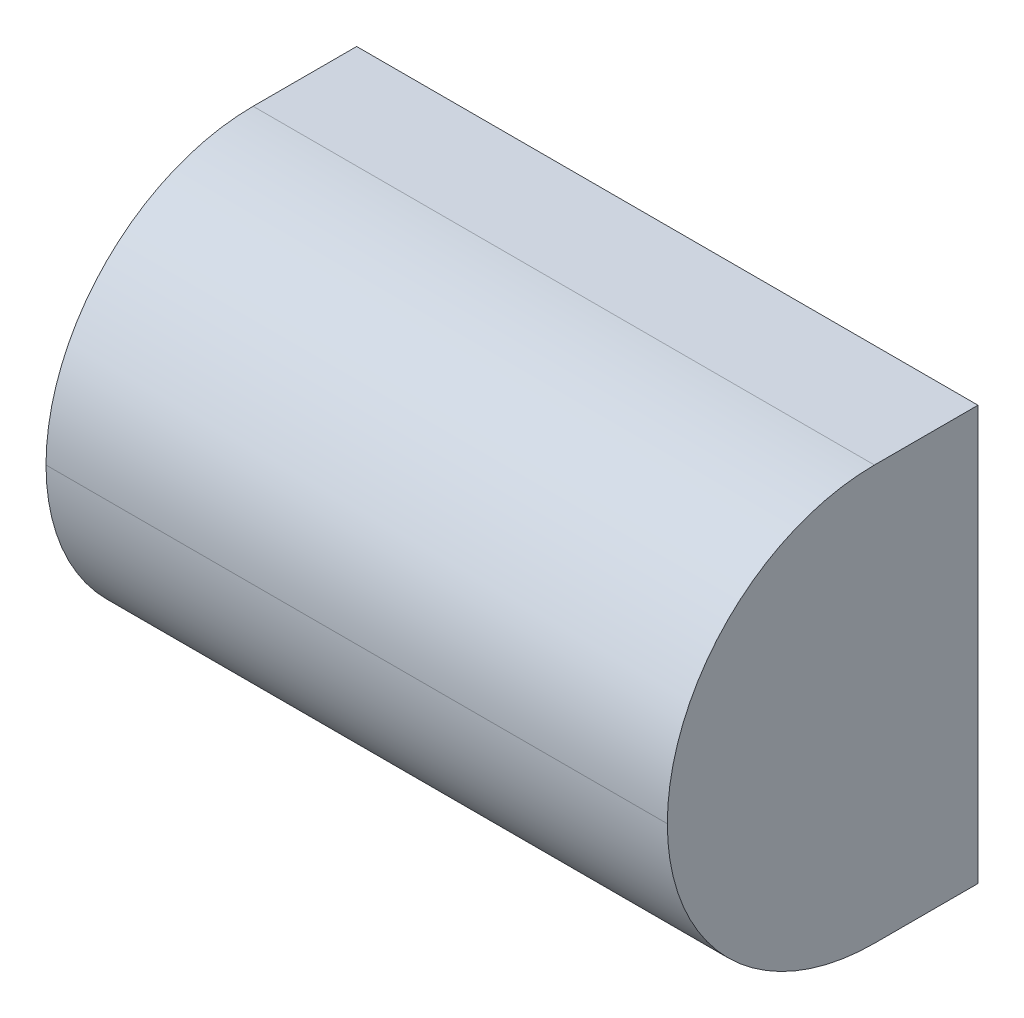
ISO-10303-21;
HEADER;
FILE_DESCRIPTION(('STEP AP214'),'2;1');
FILE_NAME('part.step','',(''),(''),'','','');
FILE_SCHEMA(('AUTOMOTIVE_DESIGN { 1 0 10303 214 1 1 1 1 }'));
ENDSEC;
DATA;
#1=APPLICATION_CONTEXT('core data for automotive mechanical design processes');
#2=APPLICATION_PROTOCOL_DEFINITION('international standard','automotive_design',2000,#1);
#3=PRODUCT_CONTEXT('',#1,'mechanical');
#4=PRODUCT('Part','Part','',(#3));
#5=PRODUCT_RELATED_PRODUCT_CATEGORY('part','',(#4));
#6=PRODUCT_DEFINITION_FORMATION('','',#4);
#7=PRODUCT_DEFINITION_CONTEXT('part definition',#1,'design');
#8=PRODUCT_DEFINITION('design','',#6,#7);
#9=PRODUCT_DEFINITION_SHAPE('','',#8);
#10=(LENGTH_UNIT() NAMED_UNIT(*) SI_UNIT(.MILLI.,.METRE.));
#11=(NAMED_UNIT(*) PLANE_ANGLE_UNIT() SI_UNIT($,.RADIAN.));
#12=(NAMED_UNIT(*) SI_UNIT($,.STERADIAN.) SOLID_ANGLE_UNIT());
#13=UNCERTAINTY_MEASURE_WITH_UNIT(LENGTH_MEASURE(1.E-05),#10,'distance_accuracy_value','');
#14=(GEOMETRIC_REPRESENTATION_CONTEXT(3) GLOBAL_UNCERTAINTY_ASSIGNED_CONTEXT((#13)) GLOBAL_UNIT_ASSIGNED_CONTEXT((#10,
#11,#12)) REPRESENTATION_CONTEXT('',''));
#15=CARTESIAN_POINT('',(0.,0.,0.));
#16=DIRECTION('',(0.,0.,1.));
#17=DIRECTION('',(1.,0.,0.));
#18=AXIS2_PLACEMENT_3D('',#15,#16,#17);
#19=CARTESIAN_POINT('',(-4.5,3.,4.5));
#20=DIRECTION('',(1.,0.,0.));
#21=DIRECTION('',(0.,1.,0.));
#22=AXIS2_PLACEMENT_3D('',#19,#20,#21);
#23=PLANE('',#22);
#24=DIRECTION('',(0.,0.,-1.));
#25=VECTOR('',#24,1.);
#26=CARTESIAN_POINT('',(-4.5,-3.,4.5));
#27=LINE('',#26,#25);
#28=CARTESIAN_POINT('',(-4.5,-3.,1.5));
#29=VERTEX_POINT('',#28);
#30=CARTESIAN_POINT('',(-4.5,-3.,0.));
#31=VERTEX_POINT('',#30);
#32=EDGE_CURVE('E75',#29,#31,#27,.T.);
#33=ORIENTED_EDGE('',*,*,#32,.F.);
#34=CARTESIAN_POINT('',(-4.5,0.,1.5));
#35=DIRECTION('',(1.,0.,0.));
#36=DIRECTION('',(0.,1.,0.));
#37=AXIS2_PLACEMENT_3D('',#34,#35,#36);
#38=CIRCLE('',#37,3.);
#39=CARTESIAN_POINT('',(-4.5,0.,4.5));
#40=VERTEX_POINT('',#39);
#41=EDGE_CURVE('E40',#29,#40,#38,.F.);
#42=ORIENTED_EDGE('',*,*,#41,.T.);
#43=CARTESIAN_POINT('',(-4.5,0.,1.5));
#44=DIRECTION('',(1.,0.,0.));
#45=DIRECTION('',(0.,1.,0.));
#46=AXIS2_PLACEMENT_3D('',#43,#44,#45);
#47=CIRCLE('',#46,3.);
#48=CARTESIAN_POINT('',(-4.5,3.,1.5));
#49=VERTEX_POINT('',#48);
#50=EDGE_CURVE('E47',#40,#49,#47,.F.);
#51=ORIENTED_EDGE('',*,*,#50,.T.);
#52=DIRECTION('',(0.,0.,-1.));
#53=VECTOR('',#52,1.);
#54=CARTESIAN_POINT('',(-4.5,3.,4.5));
#55=LINE('',#54,#53);
#56=CARTESIAN_POINT('',(-4.5,3.,0.));
#57=VERTEX_POINT('',#56);
#58=EDGE_CURVE('E95',#49,#57,#55,.T.);
#59=ORIENTED_EDGE('',*,*,#58,.T.);
#60=DIRECTION('',(0.,-1.,0.));
#61=VECTOR('',#60,1.);
#62=CARTESIAN_POINT('',(-4.5,3.,0.));
#63=LINE('',#62,#61);
#64=EDGE_CURVE('E91',#57,#31,#63,.T.);
#65=ORIENTED_EDGE('',*,*,#64,.T.);
#66=EDGE_LOOP('',(#33,#42,#51,#59,#65));
#67=FACE_BOUND('',#66,.T.);
#68=ADVANCED_FACE('F33',(#67),#23,.F.);
#69=CARTESIAN_POINT('',(-4.5,-3.,4.5));
#70=DIRECTION('',(0.,1.,0.));
#71=DIRECTION('',(0.,0.,1.));
#72=AXIS2_PLACEMENT_3D('',#69,#70,#71);
#73=PLANE('',#72);
#74=DIRECTION('',(0.,0.,-1.));
#75=VECTOR('',#74,1.);
#76=CARTESIAN_POINT('',(4.5,-3.,4.5));
#77=LINE('',#76,#75);
#78=CARTESIAN_POINT('',(4.5,-3.,1.5));
#79=VERTEX_POINT('',#78);
#80=CARTESIAN_POINT('',(4.5,-3.,0.));
#81=VERTEX_POINT('',#80);
#82=EDGE_CURVE('E85',#79,#81,#77,.T.);
#83=ORIENTED_EDGE('',*,*,#82,.F.);
#84=DIRECTION('',(1.,0.,0.));
#85=VECTOR('',#84,1.);
#86=CARTESIAN_POINT('',(-4.5,-3.,1.5));
#87=LINE('',#86,#85);
#88=EDGE_CURVE('E82',#79,#29,#87,.F.);
#89=ORIENTED_EDGE('',*,*,#88,.T.);
#90=ORIENTED_EDGE('',*,*,#32,.T.);
#91=DIRECTION('',(1.,0.,0.));
#92=VECTOR('',#91,1.);
#93=CARTESIAN_POINT('',(-4.5,-3.,0.));
#94=LINE('',#93,#92);
#95=EDGE_CURVE('E79',#31,#81,#94,.T.);
#96=ORIENTED_EDGE('',*,*,#95,.T.);
#97=EDGE_LOOP('',(#83,#89,#90,#96));
#98=FACE_BOUND('',#97,.T.);
#99=ADVANCED_FACE('F78',(#98),#73,.F.);
#100=CARTESIAN_POINT('',(4.5,3.,4.5));
#101=DIRECTION('',(-1.,0.,0.));
#102=DIRECTION('',(0.,-1.,0.));
#103=AXIS2_PLACEMENT_3D('',#100,#101,#102);
#104=PLANE('',#103);
#105=CARTESIAN_POINT('',(4.5,0.,1.5));
#106=DIRECTION('',(-1.,0.,0.));
#107=DIRECTION('',(0.,-1.,0.));
#108=AXIS2_PLACEMENT_3D('',#105,#106,#107);
#109=CIRCLE('',#108,3.);
#110=CARTESIAN_POINT('',(4.5,3.,1.5));
#111=VERTEX_POINT('',#110);
#112=CARTESIAN_POINT('',(4.5,0.,4.5));
#113=VERTEX_POINT('',#112);
#114=EDGE_CURVE('E84',#111,#113,#109,.F.);
#115=ORIENTED_EDGE('',*,*,#114,.T.);
#116=CARTESIAN_POINT('',(4.5,0.,1.5));
#117=DIRECTION('',(-1.,0.,0.));
#118=DIRECTION('',(0.,-1.,0.));
#119=AXIS2_PLACEMENT_3D('',#116,#117,#118);
#120=CIRCLE('',#119,3.);
#121=EDGE_CURVE('E110',#113,#79,#120,.F.);
#122=ORIENTED_EDGE('',*,*,#121,.T.);
#123=ORIENTED_EDGE('',*,*,#82,.T.);
#124=DIRECTION('',(0.,1.,0.));
#125=VECTOR('',#124,1.);
#126=CARTESIAN_POINT('',(4.5,3.,0.));
#127=LINE('',#126,#125);
#128=CARTESIAN_POINT('',(4.5,3.,0.));
#129=VERTEX_POINT('',#128);
#130=EDGE_CURVE('E93',#81,#129,#127,.T.);
#131=ORIENTED_EDGE('',*,*,#130,.T.);
#132=DIRECTION('',(0.,0.,-1.));
#133=VECTOR('',#132,1.);
#134=CARTESIAN_POINT('',(4.5,3.,4.5));
#135=LINE('',#134,#133);
#136=EDGE_CURVE('E106',#111,#129,#135,.T.);
#137=ORIENTED_EDGE('',*,*,#136,.F.);
#138=EDGE_LOOP('',(#115,#122,#123,#131,#137));
#139=FACE_BOUND('',#138,.T.);
#140=ADVANCED_FACE('F115',(#139),#104,.F.);
#141=CARTESIAN_POINT('',(-4.5,3.,4.5));
#142=DIRECTION('',(0.,-1.,0.));
#143=DIRECTION('',(0.,0.,-1.));
#144=AXIS2_PLACEMENT_3D('',#141,#142,#143);
#145=PLANE('',#144);
#146=ORIENTED_EDGE('',*,*,#58,.F.);
#147=DIRECTION('',(-1.,0.,0.));
#148=VECTOR('',#147,1.);
#149=CARTESIAN_POINT('',(4.5,3.,1.5));
#150=LINE('',#149,#148);
#151=EDGE_CURVE('E11',#49,#111,#150,.F.);
#152=ORIENTED_EDGE('',*,*,#151,.T.);
#153=ORIENTED_EDGE('',*,*,#136,.T.);
#154=DIRECTION('',(-1.,0.,0.));
#155=VECTOR('',#154,1.);
#156=CARTESIAN_POINT('',(-4.5,3.,0.));
#157=LINE('',#156,#155);
#158=EDGE_CURVE('E103',#129,#57,#157,.T.);
#159=ORIENTED_EDGE('',*,*,#158,.T.);
#160=EDGE_LOOP('',(#146,#152,#153,#159));
#161=FACE_BOUND('',#160,.T.);
#162=ADVANCED_FACE('F125',(#161),#145,.F.);
#163=CARTESIAN_POINT('',(-4.5,-3.,0.));
#164=DIRECTION('',(0.,0.,1.));
#165=DIRECTION('',(1.,0.,0.));
#166=AXIS2_PLACEMENT_3D('',#163,#164,#165);
#167=PLANE('',#166);
#168=ORIENTED_EDGE('',*,*,#64,.F.);
#169=ORIENTED_EDGE('',*,*,#158,.F.);
#170=ORIENTED_EDGE('',*,*,#130,.F.);
#171=ORIENTED_EDGE('',*,*,#95,.F.);
#172=EDGE_LOOP('',(#168,#169,#170,#171));
#173=FACE_BOUND('',#172,.T.);
#174=ADVANCED_FACE('F89',(#173),#167,.F.);
#175=CARTESIAN_POINT('',(-4.5,0.,1.5));
#176=DIRECTION('',(1.,0.,0.));
#177=DIRECTION('',(0.,0.,-1.));
#178=AXIS2_PLACEMENT_3D('',#175,#176,#177);
#179=CYLINDRICAL_SURFACE('',#178,3.);
#180=ORIENTED_EDGE('',*,*,#151,.F.);
#181=ORIENTED_EDGE('',*,*,#50,.F.);
#182=DIRECTION('',(-1.,0.,0.));
#183=VECTOR('',#182,1.);
#184=CARTESIAN_POINT('',(-4.5,0.,4.5));
#185=LINE('',#184,#183);
#186=EDGE_CURVE('E97',#113,#40,#185,.T.);
#187=ORIENTED_EDGE('',*,*,#186,.F.);
#188=ORIENTED_EDGE('',*,*,#114,.F.);
#189=EDGE_LOOP('',(#180,#181,#187,#188));
#190=FACE_BOUND('',#189,.T.);
#191=ADVANCED_FACE('F123',(#190),#179,.T.);
#192=CARTESIAN_POINT('',(-4.5,0.,1.5));
#193=DIRECTION('',(-1.,0.,0.));
#194=DIRECTION('',(0.,0.,1.));
#195=AXIS2_PLACEMENT_3D('',#192,#193,#194);
#196=CYLINDRICAL_SURFACE('',#195,3.);
#197=ORIENTED_EDGE('',*,*,#41,.F.);
#198=ORIENTED_EDGE('',*,*,#88,.F.);
#199=ORIENTED_EDGE('',*,*,#121,.F.);
#200=ORIENTED_EDGE('',*,*,#186,.T.);
#201=EDGE_LOOP('',(#197,#198,#199,#200));
#202=FACE_BOUND('',#201,.T.);
#203=ADVANCED_FACE('F120',(#202),#196,.T.);
#204=CLOSED_SHELL('',(#68,#99,#140,#162,#174,#191,#203));
#205=MANIFOLD_SOLID_BREP('B2',#204);
#206=ADVANCED_BREP_SHAPE_REPRESENTATION('',(#18,#205),#14);
#207=SHAPE_DEFINITION_REPRESENTATION(#9,#206);
ENDSEC;
END-ISO-10303-21;
